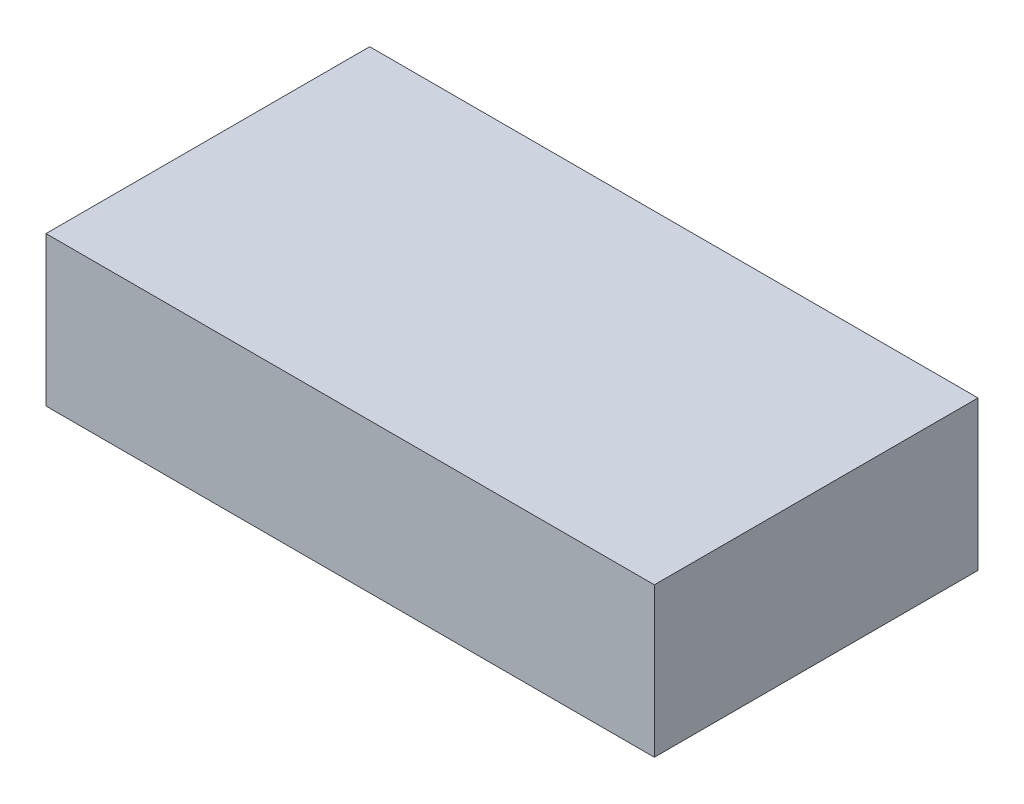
from build123d import *

# Parameters (mm, degrees)
SKETCH2_W      = 146.6
SKETCH2_H      = 36
EXTRUDE1_DEPTH = 78


with BuildPart() as part:
    # Sketch2 → Extrude1 (new body)
    with BuildSketch(Plane.XY):
        with Locations((0, 18)):
            Rectangle(SKETCH2_W, SKETCH2_H)
    extrude(amount=-EXTRUDE1_DEPTH)


solid = part.part
